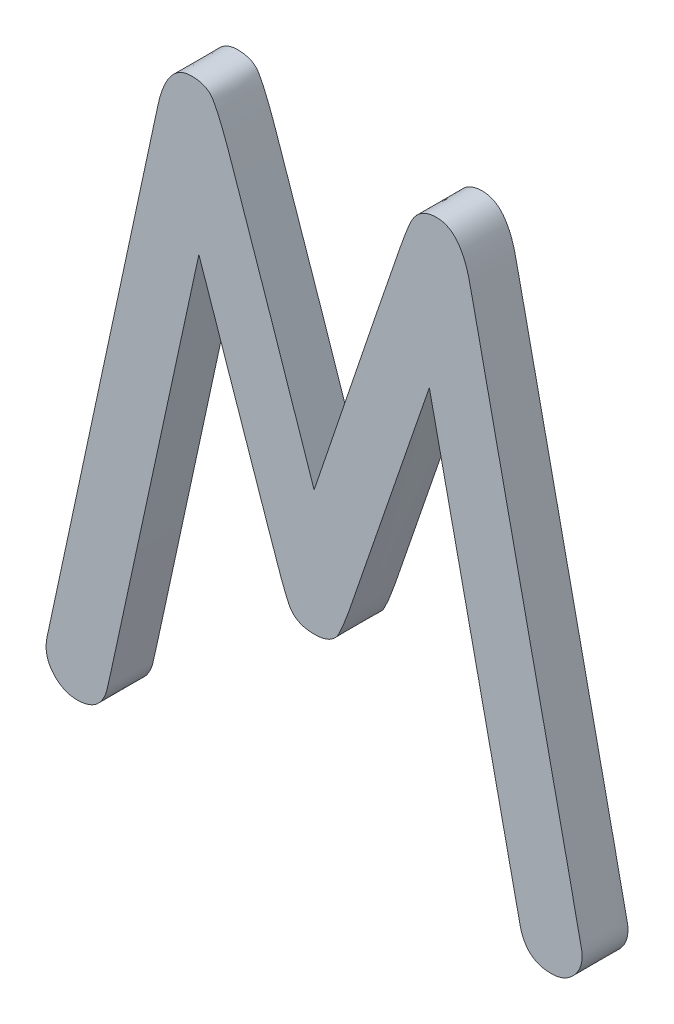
ISO-10303-21;
HEADER;
FILE_DESCRIPTION(('STEP AP214'),'2;1');
FILE_NAME('part.step','',(''),(''),'','','');
FILE_SCHEMA(('AUTOMOTIVE_DESIGN { 1 0 10303 214 1 1 1 1 }'));
ENDSEC;
DATA;
#1=APPLICATION_CONTEXT('core data for automotive mechanical design processes');
#2=APPLICATION_PROTOCOL_DEFINITION('international standard','automotive_design',2000,#1);
#3=PRODUCT_CONTEXT('',#1,'mechanical');
#4=PRODUCT('Part','Part','',(#3));
#5=PRODUCT_RELATED_PRODUCT_CATEGORY('part','',(#4));
#6=PRODUCT_DEFINITION_FORMATION('','',#4);
#7=PRODUCT_DEFINITION_CONTEXT('part definition',#1,'design');
#8=PRODUCT_DEFINITION('design','',#6,#7);
#9=PRODUCT_DEFINITION_SHAPE('','',#8);
#10=(LENGTH_UNIT() NAMED_UNIT(*) SI_UNIT(.MILLI.,.METRE.));
#11=(NAMED_UNIT(*) PLANE_ANGLE_UNIT() SI_UNIT($,.RADIAN.));
#12=(NAMED_UNIT(*) SI_UNIT($,.STERADIAN.) SOLID_ANGLE_UNIT());
#13=UNCERTAINTY_MEASURE_WITH_UNIT(LENGTH_MEASURE(1.E-05),#10,'distance_accuracy_value','');
#14=(GEOMETRIC_REPRESENTATION_CONTEXT(3) GLOBAL_UNCERTAINTY_ASSIGNED_CONTEXT((#13)) GLOBAL_UNIT_ASSIGNED_CONTEXT((#10,
#11,#12)) REPRESENTATION_CONTEXT('',''));
#15=CARTESIAN_POINT('',(0.,0.,0.));
#16=DIRECTION('',(0.,0.,1.));
#17=DIRECTION('',(1.,0.,0.));
#18=AXIS2_PLACEMENT_3D('',#15,#16,#17);
#19=CARTESIAN_POINT('',(52.4544512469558,0.663996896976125,0.500000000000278));
#20=CARTESIAN_POINT('',(52.9044512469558,2.00447308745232,0.500000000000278));
#21=CARTESIAN_POINT('',(53.3642607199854,3.3415759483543,0.500000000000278));
#22=CARTESIAN_POINT('',(53.4734988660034,3.65923499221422,0.500000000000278));
#23=CARTESIAN_POINT('',(53.5169239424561,3.73988156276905,0.500000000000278));
#24=CARTESIAN_POINT('',(53.6068321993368,3.90685403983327,0.500000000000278));
#25=CARTESIAN_POINT('',(53.7925464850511,3.90685403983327,0.500000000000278));
#26=CARTESIAN_POINT('',(54.0592131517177,3.90685403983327,0.500000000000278));
#27=CARTESIAN_POINT('',(54.1571661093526,3.45029364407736,0.500000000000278));
#28=CARTESIAN_POINT('',(54.7615941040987,0.633044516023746,0.500000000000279));
#29=CARTESIAN_POINT('',(55.3670787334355,-2.18397856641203,0.500000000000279));
#30=CARTESIAN_POINT('',(55.3782607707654,-2.23600310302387,0.500000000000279));
#31=CARTESIAN_POINT('',(55.3782607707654,-2.27886024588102,0.500000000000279));
#32=CARTESIAN_POINT('',(55.3782607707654,-2.42647929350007,0.500000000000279));
#33=CARTESIAN_POINT('',(55.2595892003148,-2.53166545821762,0.500000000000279));
#34=CARTESIAN_POINT('',(55.1687369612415,-2.61219357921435,0.500000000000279));
#35=CARTESIAN_POINT('',(55.0401655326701,-2.61219357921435,0.500000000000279));
#36=CARTESIAN_POINT('',(54.7639750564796,-2.61219357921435,0.500000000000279));
#37=CARTESIAN_POINT('',(54.7013063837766,-2.32188229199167,0.500000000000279));
#38=CARTESIAN_POINT('',(54.2068321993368,-0.031241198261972,0.500000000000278));
#39=CARTESIAN_POINT('',(53.7115941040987,2.25923499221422,0.500000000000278));
#40=B_SPLINE_CURVE_WITH_KNOTS('',2,(#19,#20,#21,#22,#23,#24,#25,#26,#27,#28,#29,#30,#31,#32,#33,
#34,#35,#36,#37,#38,#39),.UNSPECIFIED.,.F.,.F.,(3,2,2,2,2,2,2,2,2,2,3),(0.,1.,2.,3.,4.,5.,6.,7.,
8.,9.,10.),.UNSPECIFIED.);
#41=DIRECTION('',(0.,0.,-1.));
#42=VECTOR('',#41,1.);
#43=SURFACE_OF_LINEAR_EXTRUSION('',#40,#42);
#44=CARTESIAN_POINT('',(52.4544512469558,0.663996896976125,2.78196845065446E-13));
#45=CARTESIAN_POINT('',(52.9044512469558,2.00447308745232,2.78251952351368E-13));
#46=CARTESIAN_POINT('',(53.3642607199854,3.3415759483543,2.7830826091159E-13));
#47=CARTESIAN_POINT('',(53.4734988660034,3.65923499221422,2.7832163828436E-13));
#48=CARTESIAN_POINT('',(53.5169239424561,3.73988156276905,2.78326956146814E-13));
#49=CARTESIAN_POINT('',(53.6068321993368,3.90685403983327,2.78337966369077E-13));
#50=CARTESIAN_POINT('',(53.7925464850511,3.90685403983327,2.78360709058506E-13));
#51=CARTESIAN_POINT('',(54.0592131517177,3.90685403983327,2.78393365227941E-13));
#52=CARTESIAN_POINT('',(54.1571661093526,3.45029364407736,2.7840536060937E-13));
#53=CARTESIAN_POINT('',(54.7615941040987,0.633044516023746,2.78479379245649E-13));
#54=CARTESIAN_POINT('',(55.3670787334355,-2.18397856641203,2.78553527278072E-13));
#55=CARTESIAN_POINT('',(55.3782607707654,-2.23600310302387,2.78554896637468E-13));
#56=CARTESIAN_POINT('',(55.3782607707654,-2.27886024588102,2.78554896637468E-13));
#57=CARTESIAN_POINT('',(55.3782607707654,-2.42647929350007,2.78554896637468E-13));
#58=CARTESIAN_POINT('',(55.2595892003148,-2.53166545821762,2.7854036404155E-13));
#59=CARTESIAN_POINT('',(55.1687369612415,-2.61219357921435,2.78529238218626E-13));
#60=CARTESIAN_POINT('',(55.0401655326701,-2.61219357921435,2.78513493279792E-13));
#61=CARTESIAN_POINT('',(54.7639750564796,-2.61219357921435,2.78479670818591E-13));
#62=CARTESIAN_POINT('',(54.7013063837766,-2.32188229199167,2.78471996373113E-13));
#63=CARTESIAN_POINT('',(54.2068321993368,-0.031241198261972,2.78411442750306E-13));
#64=CARTESIAN_POINT('',(53.7115941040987,2.25923499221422,2.78350795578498E-13));
#65=B_SPLINE_CURVE_WITH_KNOTS('',2,(#44,#45,#46,#47,#48,#49,#50,#51,#52,#53,#54,#55,#56,#57,#58,
#59,#60,#61,#62,#63,#64),.UNSPECIFIED.,.F.,.F.,(3,2,2,2,2,2,2,2,2,2,3),(0.,1.,2.,3.,4.,5.,6.,7.,
8.,9.,10.),.UNSPECIFIED.);
#66=CARTESIAN_POINT('',(52.4544512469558,0.663996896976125,2.78196845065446E-13));
#67=VERTEX_POINT('',#66);
#68=CARTESIAN_POINT('',(53.7115941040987,2.25923499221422,2.78350795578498E-13));
#69=VERTEX_POINT('',#68);
#70=EDGE_CURVE('E50',#67,#69,#65,.T.);
#71=ORIENTED_EDGE('',*,*,#70,.F.);
#72=DIRECTION('',(0.,0.,-1.));
#73=VECTOR('',#72,1.);
#74=CARTESIAN_POINT('',(52.4544512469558,0.663996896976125,0.500000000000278));
#75=LINE('',#74,#73);
#76=CARTESIAN_POINT('',(52.4544512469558,0.663996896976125,0.500000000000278));
#77=VERTEX_POINT('',#76);
#78=EDGE_CURVE('E32',#77,#67,#75,.T.);
#79=ORIENTED_EDGE('',*,*,#78,.F.);
#80=CARTESIAN_POINT('',(53.7115941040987,2.25923499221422,0.500000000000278));
#81=VERTEX_POINT('',#80);
#82=EDGE_CURVE('E52',#77,#81,#40,.T.);
#83=ORIENTED_EDGE('',*,*,#82,.T.);
#84=DIRECTION('',(0.,0.,-1.));
#85=VECTOR('',#84,1.);
#86=CARTESIAN_POINT('',(53.7115941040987,2.25923499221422,0.500000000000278));
#87=LINE('',#86,#85);
#88=EDGE_CURVE('E11',#81,#69,#87,.T.);
#89=ORIENTED_EDGE('',*,*,#88,.T.);
#90=EDGE_LOOP('',(#71,#79,#83,#89));
#91=FACE_BOUND('',#90,.T.);
#92=ADVANCED_FACE('F16',(#91),#43,.T.);
#93=CARTESIAN_POINT('',(53.7115941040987,2.25923499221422,0.500000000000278));
#94=CARTESIAN_POINT('',(53.297308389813,1.05209213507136,0.500000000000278));
#95=CARTESIAN_POINT('',(52.8822712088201,-0.154792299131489,0.500000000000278));
#96=CARTESIAN_POINT('',(52.7544512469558,-0.526479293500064,0.500000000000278));
#97=CARTESIAN_POINT('',(52.7035941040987,-0.594288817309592,0.500000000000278));
#98=CARTESIAN_POINT('',(52.6258798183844,-0.697907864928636,0.500000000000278));
#99=CARTESIAN_POINT('',(52.4544512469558,-0.697907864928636,0.500000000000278));
#100=CARTESIAN_POINT('',(52.2782607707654,-0.697907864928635,0.500000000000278));
#101=CARTESIAN_POINT('',(52.2024180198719,-0.592894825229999,0.500000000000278));
#102=CARTESIAN_POINT('',(52.1544512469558,-0.526479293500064,0.500000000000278));
#103=CARTESIAN_POINT('',(52.0266312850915,-0.154792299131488,0.500000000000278));
#104=CARTESIAN_POINT('',(51.6115941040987,1.05209213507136,0.500000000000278));
#105=CARTESIAN_POINT('',(51.197308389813,2.25923499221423,0.500000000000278));
#106=B_SPLINE_CURVE_WITH_KNOTS('',2,(#93,#94,#95,#96,#97,#98,#99,#100,#101,#102,#103,#104,#105),
.UNSPECIFIED.,.F.,.F.,(3,2,2,2,2,2,3),(10.,11.,12.,13.,14.,15.,16.),.UNSPECIFIED.);
#107=DIRECTION('',(0.,0.,-1.));
#108=VECTOR('',#107,1.);
#109=SURFACE_OF_LINEAR_EXTRUSION('',#106,#108);
#110=CARTESIAN_POINT('',(53.7115941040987,2.25923499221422,2.78350795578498E-13));
#111=CARTESIAN_POINT('',(53.297308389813,1.05209213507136,2.78300061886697E-13));
#112=CARTESIAN_POINT('',(52.8822712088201,-0.154792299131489,2.78249236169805E-13));
#113=CARTESIAN_POINT('',(52.7544512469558,-0.526479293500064,2.78233583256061E-13));
#114=CARTESIAN_POINT('',(52.7035941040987,-0.594288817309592,2.78227355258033E-13));
#115=CARTESIAN_POINT('',(52.6258798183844,-0.697907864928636,2.78217838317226E-13));
#116=CARTESIAN_POINT('',(52.4544512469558,-0.697907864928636,2.78196845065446E-13));
#117=CARTESIAN_POINT('',(52.2782607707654,-0.697907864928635,2.78175268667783E-13));
#118=CARTESIAN_POINT('',(52.2024180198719,-0.592894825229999,2.7816598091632E-13));
#119=CARTESIAN_POINT('',(52.1544512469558,-0.526479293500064,2.78160106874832E-13));
#120=CARTESIAN_POINT('',(52.0266312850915,-0.154792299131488,2.78144453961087E-13));
#121=CARTESIAN_POINT('',(51.6115941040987,1.05209213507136,2.78093628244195E-13));
#122=CARTESIAN_POINT('',(51.197308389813,2.25923499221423,2.78042894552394E-13));
#123=B_SPLINE_CURVE_WITH_KNOTS('',2,(#110,#111,#112,#113,#114,#115,#116,#117,#118,#119,#120,
#121,#122),.UNSPECIFIED.,.F.,.F.,(3,2,2,2,2,2,3),(10.,11.,12.,13.,14.,15.,16.),.UNSPECIFIED.);
#124=CARTESIAN_POINT('',(51.197308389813,2.25923499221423,2.78042894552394E-13));
#125=VERTEX_POINT('',#124);
#126=EDGE_CURVE('E56',#69,#125,#123,.T.);
#127=ORIENTED_EDGE('',*,*,#126,.F.);
#128=ORIENTED_EDGE('',*,*,#88,.F.);
#129=CARTESIAN_POINT('',(51.197308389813,2.25923499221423,0.500000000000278));
#130=VERTEX_POINT('',#129);
#131=EDGE_CURVE('E96',#81,#130,#106,.T.);
#132=ORIENTED_EDGE('',*,*,#131,.T.);
#133=DIRECTION('',(0.,0.,-1.));
#134=VECTOR('',#133,1.);
#135=CARTESIAN_POINT('',(51.197308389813,2.25923499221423,0.500000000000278));
#136=LINE('',#135,#134);
#137=EDGE_CURVE('E25',#130,#125,#136,.T.);
#138=ORIENTED_EDGE('',*,*,#137,.T.);
#139=EDGE_LOOP('',(#127,#128,#132,#138));
#140=FACE_BOUND('',#139,.T.);
#141=ADVANCED_FACE('F57',(#140),#109,.T.);
#142=CARTESIAN_POINT('',(51.197308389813,2.25923499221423,0.500000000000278));
#143=CARTESIAN_POINT('',(50.7020702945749,-0.0312411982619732,0.500000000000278));
#144=CARTESIAN_POINT('',(50.2035607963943,-2.32100516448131,0.500000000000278));
#145=CARTESIAN_POINT('',(50.1401655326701,-2.61219357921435,0.500000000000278));
#146=CARTESIAN_POINT('',(49.8687369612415,-2.61219357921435,0.500000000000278));
#147=CARTESIAN_POINT('',(49.7401655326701,-2.61219357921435,0.500000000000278));
#148=CARTESIAN_POINT('',(49.6493132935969,-2.53166545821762,0.500000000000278));
#149=CARTESIAN_POINT('',(49.5306417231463,-2.42647929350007,0.500000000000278));
#150=CARTESIAN_POINT('',(49.5306417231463,-2.27409834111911,0.500000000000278));
#151=CARTESIAN_POINT('',(49.5306417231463,-2.23124119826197,0.500000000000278));
#152=CARTESIAN_POINT('',(49.5408240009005,-2.18376336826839,0.500000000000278));
#153=CARTESIAN_POINT('',(50.144927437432,0.633044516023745,0.500000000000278));
#154=CARTESIAN_POINT('',(50.7512085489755,3.44938413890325,0.500000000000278));
#155=CARTESIAN_POINT('',(50.8496893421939,3.90685403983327,0.500000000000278));
#156=CARTESIAN_POINT('',(51.1163560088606,3.90685403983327,0.500000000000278));
#157=CARTESIAN_POINT('',(51.2544512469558,3.90685403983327,0.500000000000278));
#158=CARTESIAN_POINT('',(51.3211179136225,3.8401873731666,0.500000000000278));
#159=CARTESIAN_POINT('',(51.3925464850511,3.76875880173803,0.500000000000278));
#160=CARTESIAN_POINT('',(51.5411372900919,3.34033161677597,0.500000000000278));
#161=CARTESIAN_POINT('',(52.0044512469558,2.00447308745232,0.500000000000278));
#162=CARTESIAN_POINT('',(52.4544512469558,0.663996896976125,0.500000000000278));
#163=B_SPLINE_CURVE_WITH_KNOTS('',2,(#142,#143,#144,#145,#146,#147,#148,#149,#150,#151,#152,
#153,#154,#155,#156,#157,#158,#159,#160,#161,#162),.UNSPECIFIED.,.F.,.F.,(3,2,2,2,2,2,2,2,2,2,
3),(16.,17.,18.,19.,20.,21.,22.,23.,24.,25.,26.),.UNSPECIFIED.);
#164=DIRECTION('',(0.,0.,-1.));
#165=VECTOR('',#164,1.);
#166=SURFACE_OF_LINEAR_EXTRUSION('',#163,#165);
#167=CARTESIAN_POINT('',(51.197308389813,2.25923499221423,2.78042894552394E-13));
#168=CARTESIAN_POINT('',(50.7020702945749,-0.0312411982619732,2.77982247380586E-13));
#169=CARTESIAN_POINT('',(50.2035607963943,-2.32100516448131,2.77921199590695E-13));
#170=CARTESIAN_POINT('',(50.1401655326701,-2.61219357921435,2.77913436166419E-13));
#171=CARTESIAN_POINT('',(49.8687369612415,-2.61219357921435,2.77880196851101E-13));
#172=CARTESIAN_POINT('',(49.7401655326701,-2.61219357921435,2.77864451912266E-13));
#173=CARTESIAN_POINT('',(49.6493132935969,-2.53166545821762,2.77853326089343E-13));
#174=CARTESIAN_POINT('',(49.5306417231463,-2.42647929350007,2.77838793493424E-13));
#175=CARTESIAN_POINT('',(49.5306417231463,-2.27409834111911,2.77838793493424E-13));
#176=CARTESIAN_POINT('',(49.5306417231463,-2.23124119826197,2.77838793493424E-13));
#177=CARTESIAN_POINT('',(49.5408240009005,-2.18376336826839,2.77840040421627E-13));
#178=CARTESIAN_POINT('',(50.144927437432,0.633044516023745,2.77914019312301E-13));
#179=CARTESIAN_POINT('',(50.7512085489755,3.44938413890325,2.77988264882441E-13));
#180=CARTESIAN_POINT('',(50.8496893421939,3.90685403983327,2.78000324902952E-13));
#181=CARTESIAN_POINT('',(51.1163560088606,3.90685403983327,2.78032981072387E-13));
#182=CARTESIAN_POINT('',(51.2544512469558,3.90685403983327,2.78049892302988E-13));
#183=CARTESIAN_POINT('',(51.3211179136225,3.8401873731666,2.78058056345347E-13));
#184=CARTESIAN_POINT('',(51.3925464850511,3.76875880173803,2.78066803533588E-13));
#185=CARTESIAN_POINT('',(51.5411372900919,3.34033161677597,2.78085000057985E-13));
#186=CARTESIAN_POINT('',(52.0044512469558,2.00447308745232,2.78141737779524E-13));
#187=CARTESIAN_POINT('',(52.4544512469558,0.663996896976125,2.78196845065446E-13));
#188=B_SPLINE_CURVE_WITH_KNOTS('',2,(#167,#168,#169,#170,#171,#172,#173,#174,#175,#176,#177,
#178,#179,#180,#181,#182,#183,#184,#185,#186,#187),.UNSPECIFIED.,.F.,.F.,(3,2,2,2,2,2,2,2,2,2,
3),(16.,17.,18.,19.,20.,21.,22.,23.,24.,25.,26.),.UNSPECIFIED.);
#189=EDGE_CURVE('E61',#125,#67,#188,.T.);
#190=ORIENTED_EDGE('',*,*,#189,.F.);
#191=ORIENTED_EDGE('',*,*,#137,.F.);
#192=EDGE_CURVE('E105',#130,#77,#163,.T.);
#193=ORIENTED_EDGE('',*,*,#192,.T.);
#194=ORIENTED_EDGE('',*,*,#78,.T.);
#195=EDGE_LOOP('',(#190,#191,#193,#194));
#196=FACE_BOUND('',#195,.T.);
#197=ADVANCED_FACE('F115',(#196),#166,.T.);
#198=CARTESIAN_POINT('',(55.3670787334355,-2.18397856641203,0.500000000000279));
#199=DIRECTION('',(0.,0.,1.));
#200=DIRECTION('',(0.948007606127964,-0.318247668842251,0.));
#201=AXIS2_PLACEMENT_3D('',#198,#199,#200);
#202=PLANE('',#201);
#203=ORIENTED_EDGE('',*,*,#82,.F.);
#204=ORIENTED_EDGE('',*,*,#192,.F.);
#205=ORIENTED_EDGE('',*,*,#131,.F.);
#206=EDGE_LOOP('',(#203,#204,#205));
#207=FACE_BOUND('',#206,.T.);
#208=ADVANCED_FACE('F118',(#207),#202,.T.);
#209=CARTESIAN_POINT('',(55.3670787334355,-2.18397856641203,2.78553527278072E-13));
#210=DIRECTION('',(0.,0.,1.));
#211=DIRECTION('',(0.948007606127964,-0.318247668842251,0.));
#212=AXIS2_PLACEMENT_3D('',#209,#210,#211);
#213=PLANE('',#212);
#214=ORIENTED_EDGE('',*,*,#70,.T.);
#215=ORIENTED_EDGE('',*,*,#126,.T.);
#216=ORIENTED_EDGE('',*,*,#189,.T.);
#217=EDGE_LOOP('',(#214,#215,#216));
#218=FACE_BOUND('',#217,.T.);
#219=ADVANCED_FACE('F63',(#218),#213,.F.);
#220=CLOSED_SHELL('',(#92,#141,#197,#208,#219));
#221=MANIFOLD_SOLID_BREP('B1',#220);
#222=ADVANCED_BREP_SHAPE_REPRESENTATION('',(#18,#221),#14);
#223=SHAPE_DEFINITION_REPRESENTATION(#9,#222);
ENDSEC;
END-ISO-10303-21;
